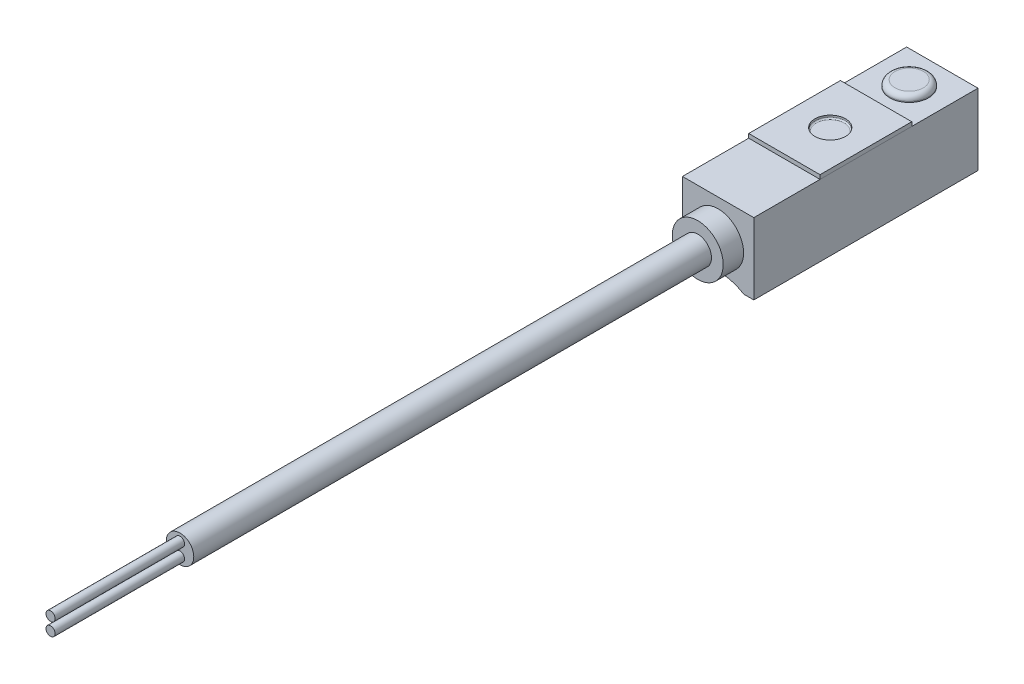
from build123d import *

# Parameters (mm, degrees)
EXTRUDE1_DEPTH = 22
SKETCH2_R      = 2.5
EXTRUDE2_DEPTH = 2
SKETCH3_W      = 7
SKETCH3_H      = 9
EXTRUDE3_DEPTH = 0.4
SKETCH4_R      = 1.5
EXTRUDE4_DEPTH = 0.3
SKETCH5_R      = 1.9
EXTRUDE5_DEPTH = 0.6
FILLET1_R      = 0.508
FILLET2_R      = 0.127
SKETCH6_R      = 1.35
EXTRUDE6_DEPTH = 50.8
SKETCH7_R      = 0.45
EXTRUDE7_DEPTH = 12.7


with BuildPart() as part:
    # Sketch1 → Extrude1 (new body)
    with BuildSketch(Plane.XY):
        with BuildLine():
            Line((2.513140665, -3.5), (3.5, -3.5))
            Line((3.5, -3.5), (3.5, 3.5))
            Line((3.5, 3.5), (-3.5, 3.5))
            Line((-3.5, 3.5), (-3.5, -3.5))
            Line((-3.5, -3.5), (-2.513140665, -3.5))
            ThreePointArc((-2.513140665, -3.5), (0, -2.794), (2.513140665, -3.5))
        make_face()
    extrude(amount=EXTRUDE1_DEPTH)

    # Sketch2 → Extrude2 (add)
    with BuildSketch(Plane.XY.offset(22)):
        Circle(SKETCH2_R)
    extrude(amount=EXTRUDE2_DEPTH)

    # Sketch5 → Extrude5 (add)
    with BuildSketch(Plane(origin=(0, 3.5, 0), x_dir=(1, 0, 0), z_dir=(0, 1, 0))):
        with Locations(Location((0, -3.25, 0), (0, 0, 90))):
            Circle(SKETCH5_R)
    extrude(amount=EXTRUDE5_DEPTH)

    # Fillet1
    fillet1_edges = [part.edges().sort_by_distance(p)[0] for p in [
        (0, 4.1, 5.15),
    ]]
    fillet(fillet1_edges, radius=FILLET1_R)

    # Sketch6 → Extrude6 (add)
    with BuildSketch(Plane.XY.offset(24)):
        Circle(SKETCH6_R)
    extrude(amount=EXTRUDE6_DEPTH)

    # Sketch7 → Extrude7 (add)
    with BuildSketch(Plane.XY.offset(74.8)):
        with Locations((0, 0.635)):
            Circle(SKETCH7_R)
        with Locations((0, -0.635)):
            Circle(SKETCH7_R)
    extrude(amount=EXTRUDE7_DEPTH)


with BuildPart() as body_2:
    # Sketch3 → Extrude3 (new body)
    with BuildSketch(Plane(origin=(0, 3.5, 0), x_dir=(1, 0, 0), z_dir=(0, 1, 0))):
        with Locations((0, -11)):
            Rectangle(SKETCH3_W, SKETCH3_H)
    extrude(amount=EXTRUDE3_DEPTH)

    # Sketch4 → Extrude4 (cut)
    with BuildSketch(Plane(origin=(0, 3.9, 0), x_dir=(1, 0, 0), z_dir=(0, 1, 0))):
        with Locations(Location((0, -11, 0), (0, 0, 270))):
            Circle(SKETCH4_R)
    extrude(amount=-EXTRUDE4_DEPTH, mode=Mode.SUBTRACT)

    # Fillet2
    fillet2_edges = [body_2.edges().sort_by_distance(p)[0] for p in [
        (0, 3.6, 9.5),
    ]]
    fillet(fillet2_edges, radius=FILLET2_R)


solid = Compound([part.part, body_2.part])
